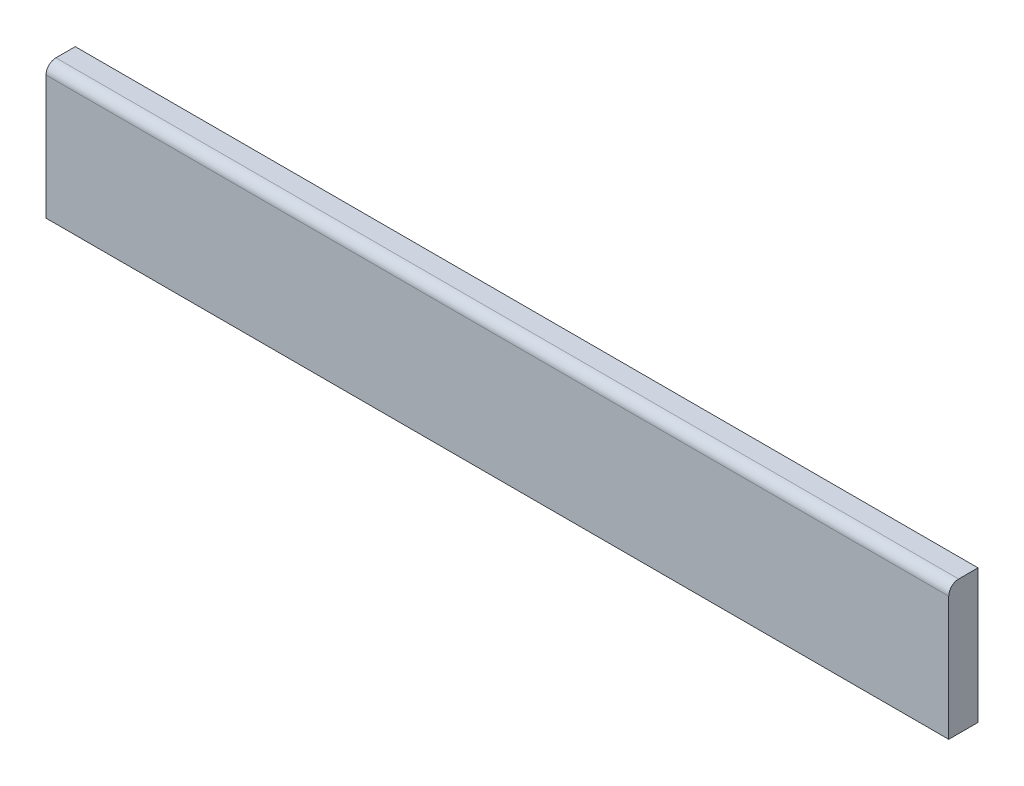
from build123d import *

# Parameters (mm, degrees)
SKETCH_1_W          = 1898
SKETCH_1_H          = 250
SKETCH_1_R          = 5
EXTRUDE_1_DEPTH     = 16
SKETCH_3_R          = 5
CUT_EXTRUDE_2_DEPTH = 963.032223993
MOVE_FACE_1_BY      = 20
MOVE_FACE_1_2_BY    = 20
MOVE_FACE_1_3_BY    = 20
SKETCH_4_W          = 1938
SKETCH_4_H          = 270
EXTRUDE_2_DEPTH     = 43
FILLET_1_R          = 20
SKETCH_5_W          = 59
SKETCH_5_H          = 59
CUT_EXTRUDE_3_DEPTH = 1008.641801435


with BuildPart() as part:
    # Sketch 1 → Extrude 1 (new body)
    with BuildSketch(Plane.XY):
        with Locations((0, -32)):
            Rectangle(SKETCH_1_W, SKETCH_1_H)
        with Locations((-490, 0)):
            Circle(SKETCH_1_R, mode=Mode.SUBTRACT)
        with Locations((-855, 0)):
            Circle(SKETCH_1_R, mode=Mode.SUBTRACT)
        with Locations((-125, 0)):
            Circle(SKETCH_1_R, mode=Mode.SUBTRACT)
        with Locations((-872.6, -137)):
            Circle(SKETCH_1_R, mode=Mode.SUBTRACT)
        with Locations((-872.6, -57)):
            Circle(SKETCH_1_R, mode=Mode.SUBTRACT)
        with Locations(Location((125, 0, 0), (0, 0, 180))):
            Circle(SKETCH_1_R, mode=Mode.SUBTRACT)
        with Locations((-793, -142)):
            Circle(SKETCH_1_R, mode=Mode.SUBTRACT)
        with Locations((872.6, -137)):
            Circle(SKETCH_1_R, mode=Mode.SUBTRACT)
        with Locations((872.6, -57)):
            Circle(SKETCH_1_R, mode=Mode.SUBTRACT)
        with Locations((-428, -142)):
            Circle(SKETCH_1_R, mode=Mode.SUBTRACT)
        with Locations((-63, -142)):
            Circle(SKETCH_1_R, mode=Mode.SUBTRACT)
        with Locations(Location((490, 0, 0), (0, 0, 180))):
            Circle(SKETCH_1_R, mode=Mode.SUBTRACT)
        with Locations(Location((855, 0, 0), (0, 0, 180))):
            Circle(SKETCH_1_R, mode=Mode.SUBTRACT)
        with Locations(Location((63, -142, 0), (0, 0, 180))):
            Circle(SKETCH_1_R, mode=Mode.SUBTRACT)
        with Locations(Location((428, -142, 0), (0, 0, 180))):
            Circle(SKETCH_1_R, mode=Mode.SUBTRACT)
        with Locations(Location((793, -142, 0), (0, 0, 180))):
            Circle(SKETCH_1_R, mode=Mode.SUBTRACT)
    extrude(amount=EXTRUDE_1_DEPTH)

    # Sketch 3 → Cut-Extrude 2 (cut, through all)
    with BuildSketch(Plane.XY.offset(16)):
        with Locations((-27, -77)):
            Circle(SKETCH_3_R)
        with Locations((-27, -41)):
            Circle(SKETCH_3_R)
        with Locations((27, -41)):
            Circle(SKETCH_3_R)
        with Locations((27, -77)):
            Circle(SKETCH_3_R)
    extrude(amount=-CUT_EXTRUDE_2_DEPTH, mode=Mode.SUBTRACT)

    # Move Face 1: a face moved outward by 20.0
    extrude(part.faces().sort_by_distance((0, 93, 8))[0], amount=MOVE_FACE_1_BY, dir=(0, 1, 0))

    # Move Face 1 2: a face moved outward by 20.0
    extrude(part.faces().sort_by_distance((949, -32, 8))[0], amount=MOVE_FACE_1_2_BY, dir=(1, 0, 0))

    # Move Face 1 3: a face moved outward by 20.0
    extrude(part.faces().sort_by_distance((-949, -32, 8))[0], amount=MOVE_FACE_1_3_BY, dir=(-1, 0, 0))

    # Sketch 4 → Extrude 2 (add)
    with BuildSketch(Plane.XY.offset(16)):
        with Locations((0, -22)):
            Rectangle(SKETCH_4_W, SKETCH_4_H)
    extrude(amount=EXTRUDE_2_DEPTH)

    # Fillet 1
    fillet_1_edges = [part.edges().sort_by_distance(p)[0] for p in [
        (0, 113, 59),
        (-969, -22, 59),
        (969, -22, 59),
        (-969, 113, 29.5),
        (969, 113, 29.5),
    ]]
    fillet(fillet_1_edges, radius=FILLET_1_R)

    # Sketch 5 → Cut-Extrude 3 (cut, through all)
    with BuildSketch(Plane(origin=(0, 113, 0), x_dir=(1, 0, 0), z_dir=(0, 1, 0))):
        with Locations((939.5, -29.5)):
            Rectangle(SKETCH_5_W, SKETCH_5_H)
        with Locations((-939.5, -29.5)):
            Rectangle(SKETCH_5_W, SKETCH_5_H)
    extrude(amount=-CUT_EXTRUDE_3_DEPTH, mode=Mode.SUBTRACT)


solid = part.part
